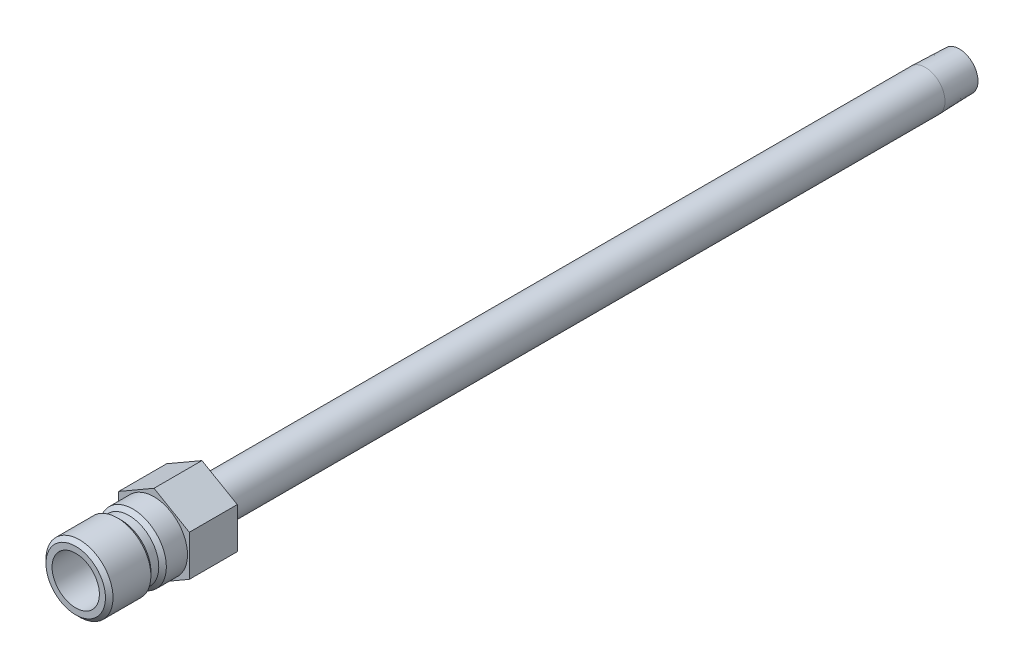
from build123d import *

# Parameters (mm, degrees)
SKETCH2_R           = 2.6543
BOSS_EXTRUDE1_DEPTH = 9.652


with BuildPart() as part:
    # Sketch1 → Revolve1 (revolve)
    with BuildSketch(Plane(origin=(0, 0, 0), x_dir=(0, 0, -1), z_dir=(1, 0, 0))):
        Polygon((-15.748, 4.7625), (-15.748, 5.9817), (-14.986, 6.7437), (-7.366, 6.7437), (-6.604, 5.9817), (-5.0165, 5.9817), (-4.2545, 6.7437), (9.652, 6.7437), (9.652, 3.96875), (155.194, 3.96875), (162.052, 3.754438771), (162.052, 2.6543), (-2.435050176, 2.6543), (-3.556, 4.7625), align=None)
    revolve(axis=Axis((0, 0, -9.652), (0, 0, 1)))

    # Sketch2 → Boss-Extrude1 (add)
    with BuildSketch(Plane.XY):
        Polygon((-7.112, 4.106115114), (-7.112, -4.106115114), (0, -8.212230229), (7.112, -4.106115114), (7.112, 4.106115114), (0, 8.212230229), align=None)
        with Locations(Location((0, 0, 0), (0, 0, 90))):
            Circle(SKETCH2_R, mode=Mode.SUBTRACT)
    extrude(amount=-BOSS_EXTRUDE1_DEPTH)


solid = part.part
